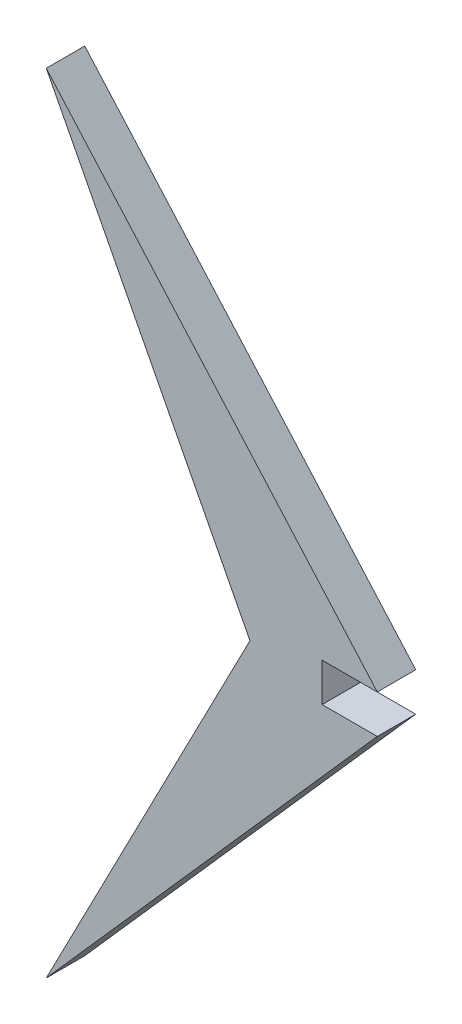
from build123d import *

# Parameters (mm, degrees)
EXTRUDE_1_DEPTH = 8


with BuildPart() as part:
    # Model → Extrude 1 (new body)
    with BuildSketch(Plane.XY):
        Polygon((142.642356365, 181.915204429), (185, 100), (142.642356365, 18.084795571), (211.466705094, 96), (200, 96), (200, 104), (211.466705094, 104), align=None)
    extrude(amount=EXTRUDE_1_DEPTH)


solid = part.part
